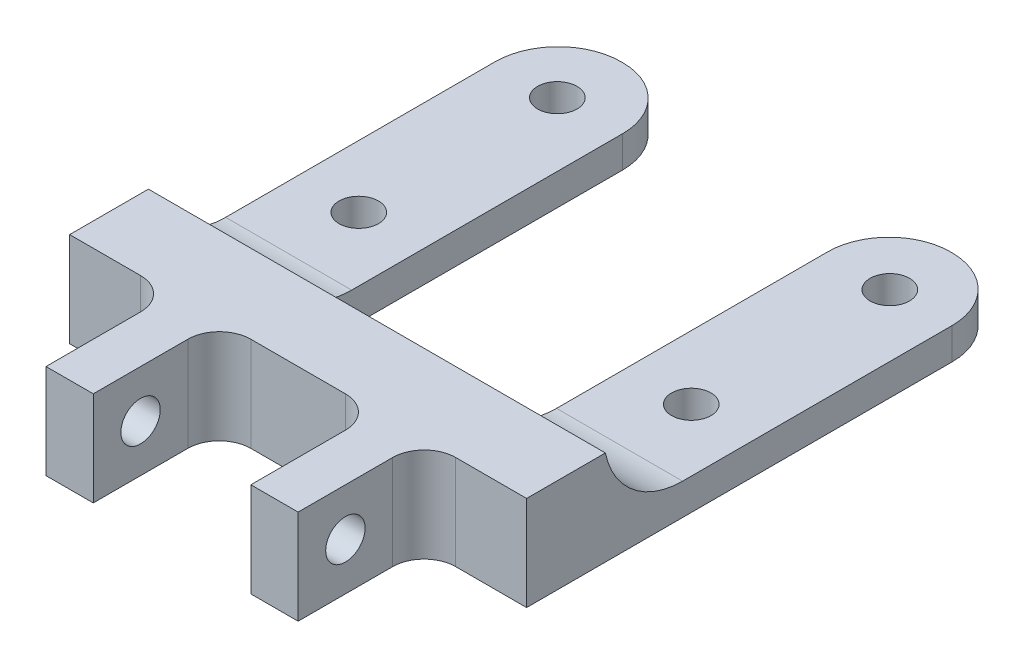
ISO-10303-21;
HEADER;
FILE_DESCRIPTION(('STEP AP214'),'2;1');
FILE_NAME('part.step','',(''),(''),'','','');
FILE_SCHEMA(('AUTOMOTIVE_DESIGN { 1 0 10303 214 1 1 1 1 }'));
ENDSEC;
DATA;
#1=APPLICATION_CONTEXT('core data for automotive mechanical design processes');
#2=APPLICATION_PROTOCOL_DEFINITION('international standard','automotive_design',2000,#1);
#3=PRODUCT_CONTEXT('',#1,'mechanical');
#4=PRODUCT('Part','Part','',(#3));
#5=PRODUCT_RELATED_PRODUCT_CATEGORY('part','',(#4));
#6=PRODUCT_DEFINITION_FORMATION('','',#4);
#7=PRODUCT_DEFINITION_CONTEXT('part definition',#1,'design');
#8=PRODUCT_DEFINITION('design','',#6,#7);
#9=PRODUCT_DEFINITION_SHAPE('','',#8);
#10=(LENGTH_UNIT() NAMED_UNIT(*) SI_UNIT(.MILLI.,.METRE.));
#11=(NAMED_UNIT(*) PLANE_ANGLE_UNIT() SI_UNIT($,.RADIAN.));
#12=(NAMED_UNIT(*) SI_UNIT($,.STERADIAN.) SOLID_ANGLE_UNIT());
#13=UNCERTAINTY_MEASURE_WITH_UNIT(LENGTH_MEASURE(1.E-05),#10,'distance_accuracy_value','');
#14=(GEOMETRIC_REPRESENTATION_CONTEXT(3) GLOBAL_UNCERTAINTY_ASSIGNED_CONTEXT((#13)) GLOBAL_UNIT_ASSIGNED_CONTEXT((#10,
#11,#12)) REPRESENTATION_CONTEXT('',''));
#15=CARTESIAN_POINT('',(0.,0.,0.));
#16=DIRECTION('',(0.,0.,1.));
#17=DIRECTION('',(1.,0.,0.));
#18=AXIS2_PLACEMENT_3D('',#15,#16,#17);
#19=CARTESIAN_POINT('',(0.,0.,5.));
#20=DIRECTION('',(0.,0.,1.));
#21=DIRECTION('',(1.,0.,0.));
#22=AXIS2_PLACEMENT_3D('',#19,#20,#21);
#23=PLANE('',#22);
#24=DIRECTION('',(1.,0.,0.));
#25=VECTOR('',#24,1.);
#26=CARTESIAN_POINT('',(0.,0.,5.));
#27=LINE('',#26,#25);
#28=CARTESIAN_POINT('',(11.5,0.,5.));
#29=VERTEX_POINT('',#28);
#30=CARTESIAN_POINT('',(17.5,0.,5.));
#31=VERTEX_POINT('',#30);
#32=EDGE_CURVE('E282',#29,#31,#27,.T.);
#33=ORIENTED_EDGE('',*,*,#32,.T.);
#34=DIRECTION('',(0.,-1.,0.));
#35=VECTOR('',#34,1.);
#36=CARTESIAN_POINT('',(17.5,0.,5.));
#37=LINE('',#36,#35);
#38=CARTESIAN_POINT('',(17.5,6.,5.));
#39=VERTEX_POINT('',#38);
#40=EDGE_CURVE('E410',#31,#39,#37,.F.);
#41=ORIENTED_EDGE('',*,*,#40,.T.);
#42=DIRECTION('',(1.,0.,0.));
#43=VECTOR('',#42,1.);
#44=CARTESIAN_POINT('',(0.,6.,5.));
#45=LINE('',#44,#43);
#46=CARTESIAN_POINT('',(11.5,6.,5.));
#47=VERTEX_POINT('',#46);
#48=EDGE_CURVE('E273',#47,#39,#45,.T.);
#49=ORIENTED_EDGE('',*,*,#48,.F.);
#50=DIRECTION('',(0.,1.,0.));
#51=VECTOR('',#50,1.);
#52=CARTESIAN_POINT('',(11.5,0.,5.));
#53=LINE('',#52,#51);
#54=EDGE_CURVE('E408',#47,#29,#53,.F.);
#55=ORIENTED_EDGE('',*,*,#54,.T.);
#56=EDGE_LOOP('',(#33,#41,#49,#55));
#57=FACE_BOUND('',#56,.T.);
#58=ADVANCED_FACE('F35',(#57),#23,.T.);
#59=CARTESIAN_POINT('',(24.5,6.,5.));
#60=VERTEX_POINT('',#59);
#61=CARTESIAN_POINT('',(29.,6.,5.));
#62=VERTEX_POINT('',#61);
#63=EDGE_CURVE('E269',#60,#62,#45,.T.);
#64=ORIENTED_EDGE('',*,*,#63,.F.);
#65=DIRECTION('',(0.,1.,0.));
#66=VECTOR('',#65,1.);
#67=CARTESIAN_POINT('',(24.5,0.,5.));
#68=LINE('',#67,#66);
#69=CARTESIAN_POINT('',(24.5,0.,5.));
#70=VERTEX_POINT('',#69);
#71=EDGE_CURVE('E415',#60,#70,#68,.F.);
#72=ORIENTED_EDGE('',*,*,#71,.T.);
#73=CARTESIAN_POINT('',(29.,0.,5.));
#74=VERTEX_POINT('',#73);
#75=EDGE_CURVE('E278',#70,#74,#27,.T.);
#76=ORIENTED_EDGE('',*,*,#75,.T.);
#77=DIRECTION('',(0.,1.,0.));
#78=VECTOR('',#77,1.);
#79=CARTESIAN_POINT('',(29.,0.,5.));
#80=LINE('',#79,#78);
#81=EDGE_CURVE('E283',#74,#62,#80,.T.);
#82=ORIENTED_EDGE('',*,*,#81,.T.);
#83=EDGE_LOOP('',(#64,#72,#76,#82));
#84=FACE_BOUND('',#83,.T.);
#85=ADVANCED_FACE('F463',(#84),#23,.T.);
#86=CARTESIAN_POINT('',(0.,2.,0.));
#87=DIRECTION('',(0.,1.,0.));
#88=DIRECTION('',(0.,0.,1.));
#89=AXIS2_PLACEMENT_3D('',#86,#87,#88);
#90=PLANE('',#89);
#91=CARTESIAN_POINT('',(3.95,2.,-22.));
#92=DIRECTION('',(0.,1.,0.));
#93=DIRECTION('',(0.,0.,1.));
#94=AXIS2_PLACEMENT_3D('',#91,#92,#93);
#95=CIRCLE('',#94,1.25);
#96=CARTESIAN_POINT('',(3.95,2.,-20.75));
#97=VERTEX_POINT('',#96);
#98=EDGE_CURVE('E325',#97,#97,#95,.T.);
#99=ORIENTED_EDGE('',*,*,#98,.F.);
#100=EDGE_LOOP('',(#99));
#101=FACE_BOUND('',#100,.T.);
#102=CARTESIAN_POINT('',(3.95,2.,-9.4));
#103=DIRECTION('',(0.,1.,0.));
#104=DIRECTION('',(0.,0.,1.));
#105=AXIS2_PLACEMENT_3D('',#102,#103,#104);
#106=CIRCLE('',#105,1.25);
#107=CARTESIAN_POINT('',(3.95,2.,-8.15));
#108=VERTEX_POINT('',#107);
#109=EDGE_CURVE('E316',#108,#108,#106,.T.);
#110=ORIENTED_EDGE('',*,*,#109,.F.);
#111=EDGE_LOOP('',(#110));
#112=FACE_BOUND('',#111,.T.);
#113=DIRECTION('',(0.,0.,-1.));
#114=VECTOR('',#113,1.);
#115=CARTESIAN_POINT('',(0.,2.,0.));
#116=LINE('',#115,#114);
#117=CARTESIAN_POINT('',(0.,2.,-4.89897948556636));
#118=VERTEX_POINT('',#117);
#119=CARTESIAN_POINT('',(0.,2.,-22.));
#120=VERTEX_POINT('',#119);
#121=EDGE_CURVE('E298',#118,#120,#116,.T.);
#122=ORIENTED_EDGE('',*,*,#121,.F.);
#123=DIRECTION('',(-1.,0.,0.));
#124=VECTOR('',#123,1.);
#125=CARTESIAN_POINT('',(29.,2.,-4.89897948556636));
#126=LINE('',#125,#124);
#127=CARTESIAN_POINT('',(8.,2.,-4.89897948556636));
#128=VERTEX_POINT('',#127);
#129=EDGE_CURVE('E392',#118,#128,#126,.F.);
#130=ORIENTED_EDGE('',*,*,#129,.T.);
#131=DIRECTION('',(0.,0.,1.));
#132=VECTOR('',#131,1.);
#133=CARTESIAN_POINT('',(8.,2.,0.));
#134=LINE('',#133,#132);
#135=CARTESIAN_POINT('',(8.,2.,-22.1));
#136=VERTEX_POINT('',#135);
#137=EDGE_CURVE('E313',#136,#128,#134,.T.);
#138=ORIENTED_EDGE('',*,*,#137,.F.);
#139=CARTESIAN_POINT('',(4.1,2.,-22.1));
#140=DIRECTION('',(0.,1.,0.));
#141=DIRECTION('',(0.,0.,1.));
#142=AXIS2_PLACEMENT_3D('',#139,#140,#141);
#143=CIRCLE('',#142,3.9);
#144=CARTESIAN_POINT('',(4.09999999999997,2.,-26.));
#145=VERTEX_POINT('',#144);
#146=EDGE_CURVE('E288',#145,#136,#143,.F.);
#147=ORIENTED_EDGE('',*,*,#146,.F.);
#148=DIRECTION('',(1.,0.,0.));
#149=VECTOR('',#148,1.);
#150=CARTESIAN_POINT('',(0.,2.,-26.));
#151=LINE('',#150,#149);
#152=CARTESIAN_POINT('',(4.00000000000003,2.,-26.));
#153=VERTEX_POINT('',#152);
#154=EDGE_CURVE('E291',#153,#145,#151,.T.);
#155=ORIENTED_EDGE('',*,*,#154,.F.);
#156=CARTESIAN_POINT('',(4.,2.,-22.));
#157=DIRECTION('',(0.,1.,0.));
#158=DIRECTION('',(0.,0.,1.));
#159=AXIS2_PLACEMENT_3D('',#156,#157,#158);
#160=CIRCLE('',#159,4.);
#161=EDGE_CURVE('E295',#120,#153,#160,.F.);
#162=ORIENTED_EDGE('',*,*,#161,.F.);
#163=EDGE_LOOP('',(#122,#130,#138,#147,#155,#162));
#164=FACE_BOUND('',#163,.T.);
#165=ADVANCED_FACE('F509',(#101,#112,#164),#90,.T.);
#166=CARTESIAN_POINT('',(4.1,2.,-22.1));
#167=DIRECTION('',(0.,-1.,0.));
#168=DIRECTION('',(0.,0.,-1.));
#169=AXIS2_PLACEMENT_3D('',#166,#167,#168);
#170=CYLINDRICAL_SURFACE('',#169,3.9);
#171=CARTESIAN_POINT('',(4.1,0.,-22.1));
#172=DIRECTION('',(0.,1.,0.));
#173=DIRECTION('',(0.,0.,1.));
#174=AXIS2_PLACEMENT_3D('',#171,#172,#173);
#175=CIRCLE('',#174,3.9);
#176=CARTESIAN_POINT('',(4.09999999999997,0.,-26.));
#177=VERTEX_POINT('',#176);
#178=CARTESIAN_POINT('',(8.,0.,-22.1));
#179=VERTEX_POINT('',#178);
#180=EDGE_CURVE('E286',#177,#179,#175,.F.);
#181=ORIENTED_EDGE('',*,*,#180,.F.);
#182=DIRECTION('',(0.,-1.,0.));
#183=VECTOR('',#182,1.);
#184=CARTESIAN_POINT('',(4.09999999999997,2.,-26.));
#185=LINE('',#184,#183);
#186=EDGE_CURVE('E388',#145,#177,#185,.T.);
#187=ORIENTED_EDGE('',*,*,#186,.F.);
#188=ORIENTED_EDGE('',*,*,#146,.T.);
#189=DIRECTION('',(0.,-1.,0.));
#190=VECTOR('',#189,1.);
#191=CARTESIAN_POINT('',(8.,2.,-22.1));
#192=LINE('',#191,#190);
#193=EDGE_CURVE('E328',#136,#179,#192,.T.);
#194=ORIENTED_EDGE('',*,*,#193,.T.);
#195=EDGE_LOOP('',(#181,#187,#188,#194));
#196=FACE_BOUND('',#195,.T.);
#197=ADVANCED_FACE('F575',(#196),#170,.T.);
#198=CARTESIAN_POINT('',(0.,2.,-26.));
#199=DIRECTION('',(0.,0.,-1.));
#200=DIRECTION('',(-1.,0.,0.));
#201=AXIS2_PLACEMENT_3D('',#198,#199,#200);
#202=PLANE('',#201);
#203=DIRECTION('',(1.,0.,0.));
#204=VECTOR('',#203,1.);
#205=CARTESIAN_POINT('',(0.,0.,-26.));
#206=LINE('',#205,#204);
#207=CARTESIAN_POINT('',(4.00000000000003,0.,-26.));
#208=VERTEX_POINT('',#207);
#209=EDGE_CURVE('E330',#208,#177,#206,.T.);
#210=ORIENTED_EDGE('',*,*,#209,.F.);
#211=DIRECTION('',(0.,-1.,0.));
#212=VECTOR('',#211,1.);
#213=CARTESIAN_POINT('',(4.00000000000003,2.,-26.));
#214=LINE('',#213,#212);
#215=EDGE_CURVE('E386',#153,#208,#214,.T.);
#216=ORIENTED_EDGE('',*,*,#215,.F.);
#217=ORIENTED_EDGE('',*,*,#154,.T.);
#218=ORIENTED_EDGE('',*,*,#186,.T.);
#219=EDGE_LOOP('',(#210,#216,#217,#218));
#220=FACE_BOUND('',#219,.T.);
#221=ADVANCED_FACE('F571',(#220),#202,.T.);
#222=CARTESIAN_POINT('',(4.,2.,-22.));
#223=DIRECTION('',(0.,-1.,0.));
#224=DIRECTION('',(0.,0.,-1.));
#225=AXIS2_PLACEMENT_3D('',#222,#223,#224);
#226=CYLINDRICAL_SURFACE('',#225,4.);
#227=CARTESIAN_POINT('',(4.,0.,-22.));
#228=DIRECTION('',(0.,1.,0.));
#229=DIRECTION('',(0.,0.,1.));
#230=AXIS2_PLACEMENT_3D('',#227,#228,#229);
#231=CIRCLE('',#230,4.);
#232=CARTESIAN_POINT('',(0.,0.,-22.));
#233=VERTEX_POINT('',#232);
#234=EDGE_CURVE('E333',#233,#208,#231,.F.);
#235=ORIENTED_EDGE('',*,*,#234,.F.);
#236=DIRECTION('',(0.,-1.,0.));
#237=VECTOR('',#236,1.);
#238=CARTESIAN_POINT('',(0.,2.,-22.));
#239=LINE('',#238,#237);
#240=EDGE_CURVE('E384',#120,#233,#239,.T.);
#241=ORIENTED_EDGE('',*,*,#240,.F.);
#242=ORIENTED_EDGE('',*,*,#161,.T.);
#243=ORIENTED_EDGE('',*,*,#215,.T.);
#244=EDGE_LOOP('',(#235,#241,#242,#243));
#245=FACE_BOUND('',#244,.T.);
#246=ADVANCED_FACE('F568',(#245),#226,.T.);
#247=CARTESIAN_POINT('',(0.,2.,0.));
#248=DIRECTION('',(-1.,0.,0.));
#249=DIRECTION('',(0.,0.,1.));
#250=AXIS2_PLACEMENT_3D('',#247,#248,#249);
#251=PLANE('',#250);
#252=DIRECTION('',(0.,0.,-1.));
#253=VECTOR('',#252,1.);
#254=CARTESIAN_POINT('',(0.,0.,0.));
#255=LINE('',#254,#253);
#256=CARTESIAN_POINT('',(0.,0.,5.));
#257=VERTEX_POINT('',#256);
#258=EDGE_CURVE('E336',#257,#233,#255,.T.);
#259=ORIENTED_EDGE('',*,*,#258,.F.);
#260=DIRECTION('',(0.,1.,0.));
#261=VECTOR('',#260,1.);
#262=CARTESIAN_POINT('',(0.,0.,5.));
#263=LINE('',#262,#261);
#264=CARTESIAN_POINT('',(0.,6.,5.));
#265=VERTEX_POINT('',#264);
#266=EDGE_CURVE('E281',#257,#265,#263,.T.);
#267=ORIENTED_EDGE('',*,*,#266,.T.);
#268=DIRECTION('',(0.,0.,1.));
#269=VECTOR('',#268,1.);
#270=CARTESIAN_POINT('',(0.,6.,0.));
#271=LINE('',#270,#269);
#272=CARTESIAN_POINT('',(0.,6.,0.));
#273=VERTEX_POINT('',#272);
#274=EDGE_CURVE('E266',#273,#265,#271,.T.);
#275=ORIENTED_EDGE('',*,*,#274,.F.);
#276=CARTESIAN_POINT('',(0.,7.,-4.89897948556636));
#277=DIRECTION('',(-1.,0.,0.));
#278=DIRECTION('',(0.,0.,1.));
#279=AXIS2_PLACEMENT_3D('',#276,#277,#278);
#280=CIRCLE('',#279,5.);
#281=EDGE_CURVE('E405',#273,#118,#280,.F.);
#282=ORIENTED_EDGE('',*,*,#281,.T.);
#283=ORIENTED_EDGE('',*,*,#121,.T.);
#284=ORIENTED_EDGE('',*,*,#240,.T.);
#285=EDGE_LOOP('',(#259,#267,#275,#282,#283,#284));
#286=FACE_BOUND('',#285,.T.);
#287=ADVANCED_FACE('F479',(#286),#251,.T.);
#288=CARTESIAN_POINT('',(29.,2.,0.));
#289=DIRECTION('',(-1.,0.,0.));
#290=DIRECTION('',(0.,0.,1.));
#291=AXIS2_PLACEMENT_3D('',#288,#289,#290);
#292=PLANE('',#291);
#293=DIRECTION('',(0.,0.,-1.));
#294=VECTOR('',#293,1.);
#295=CARTESIAN_POINT('',(29.,0.,0.));
#296=LINE('',#295,#294);
#297=CARTESIAN_POINT('',(29.,0.,-22.));
#298=VERTEX_POINT('',#297);
#299=EDGE_CURVE('E339',#74,#298,#296,.T.);
#300=ORIENTED_EDGE('',*,*,#299,.T.);
#301=DIRECTION('',(0.,-1.,0.));
#302=VECTOR('',#301,1.);
#303=CARTESIAN_POINT('',(29.,2.,-22.));
#304=LINE('',#303,#302);
#305=CARTESIAN_POINT('',(29.,2.,-22.));
#306=VERTEX_POINT('',#305);
#307=EDGE_CURVE('E382',#306,#298,#304,.T.);
#308=ORIENTED_EDGE('',*,*,#307,.F.);
#309=DIRECTION('',(0.,0.,-1.));
#310=VECTOR('',#309,1.);
#311=CARTESIAN_POINT('',(29.,2.,0.));
#312=LINE('',#311,#310);
#313=CARTESIAN_POINT('',(29.,2.,-4.89897948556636));
#314=VERTEX_POINT('',#313);
#315=EDGE_CURVE('E300',#314,#306,#312,.T.);
#316=ORIENTED_EDGE('',*,*,#315,.F.);
#317=CARTESIAN_POINT('',(29.,7.,-4.89897948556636));
#318=DIRECTION('',(-1.,0.,0.));
#319=DIRECTION('',(0.,0.,1.));
#320=AXIS2_PLACEMENT_3D('',#317,#318,#319);
#321=CIRCLE('',#320,5.);
#322=CARTESIAN_POINT('',(29.,6.,0.));
#323=VERTEX_POINT('',#322);
#324=EDGE_CURVE('E403',#314,#323,#321,.T.);
#325=ORIENTED_EDGE('',*,*,#324,.T.);
#326=DIRECTION('',(0.,0.,-1.));
#327=VECTOR('',#326,1.);
#328=CARTESIAN_POINT('',(29.,6.,0.));
#329=LINE('',#328,#327);
#330=EDGE_CURVE('E272',#62,#323,#329,.T.);
#331=ORIENTED_EDGE('',*,*,#330,.F.);
#332=ORIENTED_EDGE('',*,*,#81,.F.);
#333=EDGE_LOOP('',(#300,#308,#316,#325,#331,#332));
#334=FACE_BOUND('',#333,.T.);
#335=ADVANCED_FACE('F467',(#334),#292,.F.);
#336=CARTESIAN_POINT('',(25.,2.,-22.));
#337=DIRECTION('',(0.,-1.,0.));
#338=DIRECTION('',(0.,0.,-1.));
#339=AXIS2_PLACEMENT_3D('',#336,#337,#338);
#340=CYLINDRICAL_SURFACE('',#339,4.);
#341=CARTESIAN_POINT('',(25.,0.,-22.));
#342=DIRECTION('',(0.,1.,0.));
#343=DIRECTION('',(0.,0.,1.));
#344=AXIS2_PLACEMENT_3D('',#341,#342,#343);
#345=CIRCLE('',#344,4.);
#346=CARTESIAN_POINT('',(25.,0.,-26.));
#347=VERTEX_POINT('',#346);
#348=EDGE_CURVE('E342',#347,#298,#345,.F.);
#349=ORIENTED_EDGE('',*,*,#348,.F.);
#350=DIRECTION('',(0.,-1.,0.));
#351=VECTOR('',#350,1.);
#352=CARTESIAN_POINT('',(25.,2.,-26.));
#353=LINE('',#352,#351);
#354=CARTESIAN_POINT('',(25.,2.,-26.));
#355=VERTEX_POINT('',#354);
#356=EDGE_CURVE('E380',#355,#347,#353,.T.);
#357=ORIENTED_EDGE('',*,*,#356,.F.);
#358=CARTESIAN_POINT('',(25.,2.,-22.));
#359=DIRECTION('',(0.,1.,0.));
#360=DIRECTION('',(0.,0.,1.));
#361=AXIS2_PLACEMENT_3D('',#358,#359,#360);
#362=CIRCLE('',#361,4.);
#363=EDGE_CURVE('E302',#355,#306,#362,.F.);
#364=ORIENTED_EDGE('',*,*,#363,.T.);
#365=ORIENTED_EDGE('',*,*,#307,.T.);
#366=EDGE_LOOP('',(#349,#357,#364,#365));
#367=FACE_BOUND('',#366,.T.);
#368=ADVANCED_FACE('F559',(#367),#340,.T.);
#369=CARTESIAN_POINT('',(0.,2.,-26.));
#370=DIRECTION('',(0.,0.,-1.));
#371=DIRECTION('',(-1.,0.,0.));
#372=AXIS2_PLACEMENT_3D('',#369,#370,#371);
#373=PLANE('',#372);
#374=DIRECTION('',(1.,0.,0.));
#375=VECTOR('',#374,1.);
#376=CARTESIAN_POINT('',(0.,0.,-26.));
#377=LINE('',#376,#375);
#378=CARTESIAN_POINT('',(24.9,0.,-26.));
#379=VERTEX_POINT('',#378);
#380=EDGE_CURVE('E345',#379,#347,#377,.T.);
#381=ORIENTED_EDGE('',*,*,#380,.F.);
#382=DIRECTION('',(0.,-1.,0.));
#383=VECTOR('',#382,1.);
#384=CARTESIAN_POINT('',(24.9,2.,-26.));
#385=LINE('',#384,#383);
#386=CARTESIAN_POINT('',(24.9,2.,-26.));
#387=VERTEX_POINT('',#386);
#388=EDGE_CURVE('E378',#387,#379,#385,.T.);
#389=ORIENTED_EDGE('',*,*,#388,.F.);
#390=DIRECTION('',(1.,0.,0.));
#391=VECTOR('',#390,1.);
#392=CARTESIAN_POINT('',(0.,2.,-26.));
#393=LINE('',#392,#391);
#394=EDGE_CURVE('E305',#387,#355,#393,.T.);
#395=ORIENTED_EDGE('',*,*,#394,.T.);
#396=ORIENTED_EDGE('',*,*,#356,.T.);
#397=EDGE_LOOP('',(#381,#389,#395,#396));
#398=FACE_BOUND('',#397,.T.);
#399=ADVANCED_FACE('F555',(#398),#373,.T.);
#400=CARTESIAN_POINT('',(24.9,2.,-22.1));
#401=DIRECTION('',(0.,-1.,0.));
#402=DIRECTION('',(0.,0.,-1.));
#403=AXIS2_PLACEMENT_3D('',#400,#401,#402);
#404=CYLINDRICAL_SURFACE('',#403,3.9);
#405=CARTESIAN_POINT('',(24.9,0.,-22.1));
#406=DIRECTION('',(0.,1.,0.));
#407=DIRECTION('',(0.,0.,1.));
#408=AXIS2_PLACEMENT_3D('',#405,#406,#407);
#409=CIRCLE('',#408,3.9);
#410=CARTESIAN_POINT('',(21.,0.,-22.1));
#411=VERTEX_POINT('',#410);
#412=EDGE_CURVE('E348',#379,#411,#409,.T.);
#413=ORIENTED_EDGE('',*,*,#412,.T.);
#414=DIRECTION('',(0.,-1.,0.));
#415=VECTOR('',#414,1.);
#416=CARTESIAN_POINT('',(21.,2.,-22.1));
#417=LINE('',#416,#415);
#418=CARTESIAN_POINT('',(21.,2.,-22.1));
#419=VERTEX_POINT('',#418);
#420=EDGE_CURVE('E375',#419,#411,#417,.T.);
#421=ORIENTED_EDGE('',*,*,#420,.F.);
#422=CARTESIAN_POINT('',(24.9,2.,-22.1));
#423=DIRECTION('',(0.,1.,0.));
#424=DIRECTION('',(0.,0.,1.));
#425=AXIS2_PLACEMENT_3D('',#422,#423,#424);
#426=CIRCLE('',#425,3.9);
#427=EDGE_CURVE('E308',#387,#419,#426,.T.);
#428=ORIENTED_EDGE('',*,*,#427,.F.);
#429=ORIENTED_EDGE('',*,*,#388,.T.);
#430=EDGE_LOOP('',(#413,#421,#428,#429));
#431=FACE_BOUND('',#430,.T.);
#432=ADVANCED_FACE('F551',(#431),#404,.T.);
#433=CARTESIAN_POINT('',(21.,2.,0.));
#434=DIRECTION('',(1.,0.,0.));
#435=DIRECTION('',(0.,0.,-1.));
#436=AXIS2_PLACEMENT_3D('',#433,#434,#435);
#437=PLANE('',#436);
#438=DIRECTION('',(0.,0.,1.));
#439=VECTOR('',#438,1.);
#440=CARTESIAN_POINT('',(21.,0.,0.));
#441=LINE('',#440,#439);
#442=CARTESIAN_POINT('',(21.,0.,-3.5));
#443=VERTEX_POINT('',#442);
#444=EDGE_CURVE('E350',#411,#443,#441,.T.);
#445=ORIENTED_EDGE('',*,*,#444,.T.);
#446=DIRECTION('',(0.,-1.,0.));
#447=VECTOR('',#446,1.);
#448=CARTESIAN_POINT('',(21.,2.,-3.5));
#449=LINE('',#448,#447);
#450=CARTESIAN_POINT('',(21.,2.1997024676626,-3.5));
#451=VERTEX_POINT('',#450);
#452=EDGE_CURVE('E373',#451,#443,#449,.T.);
#453=ORIENTED_EDGE('',*,*,#452,.F.);
#454=CARTESIAN_POINT('',(21.,7.,-4.89897948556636));
#455=DIRECTION('',(1.,0.,0.));
#456=DIRECTION('',(0.,0.,-1.));
#457=AXIS2_PLACEMENT_3D('',#454,#455,#456);
#458=CIRCLE('',#457,5.);
#459=CARTESIAN_POINT('',(21.,2.,-4.89897948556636));
#460=VERTEX_POINT('',#459);
#461=EDGE_CURVE('E401',#451,#460,#458,.T.);
#462=ORIENTED_EDGE('',*,*,#461,.T.);
#463=DIRECTION('',(0.,0.,1.));
#464=VECTOR('',#463,1.);
#465=CARTESIAN_POINT('',(21.,2.,0.));
#466=LINE('',#465,#464);
#467=EDGE_CURVE('E310',#419,#460,#466,.T.);
#468=ORIENTED_EDGE('',*,*,#467,.F.);
#469=ORIENTED_EDGE('',*,*,#420,.T.);
#470=EDGE_LOOP('',(#445,#453,#462,#468,#469));
#471=FACE_BOUND('',#470,.T.);
#472=ADVANCED_FACE('F547',(#471),#437,.F.);
#473=CARTESIAN_POINT('',(0.,2.,-3.5));
#474=DIRECTION('',(0.,0.,-1.));
#475=DIRECTION('',(-1.,0.,0.));
#476=AXIS2_PLACEMENT_3D('',#473,#474,#475);
#477=PLANE('',#476);
#478=DIRECTION('',(1.,0.,0.));
#479=VECTOR('',#478,1.);
#480=CARTESIAN_POINT('',(0.,0.,-3.5));
#481=LINE('',#480,#479);
#482=CARTESIAN_POINT('',(8.,0.,-3.5));
#483=VERTEX_POINT('',#482);
#484=EDGE_CURVE('E353',#483,#443,#481,.T.);
#485=ORIENTED_EDGE('',*,*,#484,.F.);
#486=DIRECTION('',(0.,-1.,0.));
#487=VECTOR('',#486,1.);
#488=CARTESIAN_POINT('',(8.,2.,-3.5));
#489=LINE('',#488,#487);
#490=CARTESIAN_POINT('',(8.,2.1997024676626,-3.5));
#491=VERTEX_POINT('',#490);
#492=EDGE_CURVE('E371',#491,#483,#489,.T.);
#493=ORIENTED_EDGE('',*,*,#492,.F.);
#494=DIRECTION('',(1.,0.,0.));
#495=VECTOR('',#494,1.);
#496=CARTESIAN_POINT('',(8.,2.1997024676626,-3.5));
#497=LINE('',#496,#495);
#498=EDGE_CURVE('E398',#491,#451,#497,.T.);
#499=ORIENTED_EDGE('',*,*,#498,.T.);
#500=ORIENTED_EDGE('',*,*,#452,.T.);
#501=EDGE_LOOP('',(#485,#493,#499,#500));
#502=FACE_BOUND('',#501,.T.);
#503=ADVANCED_FACE('F533',(#502),#477,.T.);
#504=CARTESIAN_POINT('',(25.05,2.,-22.));
#505=DIRECTION('',(0.,-1.,0.));
#506=DIRECTION('',(0.,0.,-1.));
#507=AXIS2_PLACEMENT_3D('',#504,#505,#506);
#508=CYLINDRICAL_SURFACE('',#507,1.25);
#509=CARTESIAN_POINT('',(25.05,2.,-22.));
#510=DIRECTION('',(0.,1.,0.));
#511=DIRECTION('',(0.,0.,1.));
#512=AXIS2_PLACEMENT_3D('',#509,#510,#511);
#513=CIRCLE('',#512,1.25);
#514=CARTESIAN_POINT('',(25.05,2.,-20.75));
#515=VERTEX_POINT('',#514);
#516=EDGE_CURVE('E322',#515,#515,#513,.T.);
#517=ORIENTED_EDGE('',*,*,#516,.T.);
#518=EDGE_LOOP('',(#517));
#519=FACE_BOUND('',#518,.T.);
#520=CARTESIAN_POINT('',(25.05,0.,-22.));
#521=DIRECTION('',(0.,1.,0.));
#522=DIRECTION('',(0.,0.,1.));
#523=AXIS2_PLACEMENT_3D('',#520,#521,#522);
#524=CIRCLE('',#523,1.25);
#525=CARTESIAN_POINT('',(25.05,0.,-20.75));
#526=VERTEX_POINT('',#525);
#527=EDGE_CURVE('E365',#526,#526,#524,.T.);
#528=ORIENTED_EDGE('',*,*,#527,.F.);
#529=EDGE_LOOP('',(#528));
#530=FACE_BOUND('',#529,.T.);
#531=ADVANCED_FACE('F529',(#519,#530),#508,.F.);
#532=CARTESIAN_POINT('',(25.05,2.,-9.4));
#533=DIRECTION('',(0.,-1.,0.));
#534=DIRECTION('',(0.,0.,-1.));
#535=AXIS2_PLACEMENT_3D('',#532,#533,#534);
#536=CYLINDRICAL_SURFACE('',#535,1.25);
#537=CARTESIAN_POINT('',(25.05,2.,-9.4));
#538=DIRECTION('',(0.,1.,0.));
#539=DIRECTION('',(0.,0.,1.));
#540=AXIS2_PLACEMENT_3D('',#537,#538,#539);
#541=CIRCLE('',#540,1.25);
#542=CARTESIAN_POINT('',(25.05,2.,-8.15));
#543=VERTEX_POINT('',#542);
#544=EDGE_CURVE('E319',#543,#543,#541,.T.);
#545=ORIENTED_EDGE('',*,*,#544,.T.);
#546=EDGE_LOOP('',(#545));
#547=FACE_BOUND('',#546,.T.);
#548=CARTESIAN_POINT('',(25.05,0.,-9.4));
#549=DIRECTION('',(0.,1.,0.));
#550=DIRECTION('',(0.,0.,1.));
#551=AXIS2_PLACEMENT_3D('',#548,#549,#550);
#552=CIRCLE('',#551,1.25);
#553=CARTESIAN_POINT('',(25.05,0.,-8.15));
#554=VERTEX_POINT('',#553);
#555=EDGE_CURVE('E362',#554,#554,#552,.T.);
#556=ORIENTED_EDGE('',*,*,#555,.F.);
#557=EDGE_LOOP('',(#556));
#558=FACE_BOUND('',#557,.T.);
#559=ADVANCED_FACE('F532',(#547,#558),#536,.F.);
#560=CARTESIAN_POINT('',(3.95,2.,-9.4));
#561=DIRECTION('',(0.,-1.,0.));
#562=DIRECTION('',(0.,0.,-1.));
#563=AXIS2_PLACEMENT_3D('',#560,#561,#562);
#564=CYLINDRICAL_SURFACE('',#563,1.25);
#565=ORIENTED_EDGE('',*,*,#109,.T.);
#566=EDGE_LOOP('',(#565));
#567=FACE_BOUND('',#566,.T.);
#568=CARTESIAN_POINT('',(3.95,0.,-9.4));
#569=DIRECTION('',(0.,1.,0.));
#570=DIRECTION('',(0.,0.,1.));
#571=AXIS2_PLACEMENT_3D('',#568,#569,#570);
#572=CIRCLE('',#571,1.25);
#573=CARTESIAN_POINT('',(3.95,0.,-8.15));
#574=VERTEX_POINT('',#573);
#575=EDGE_CURVE('E359',#574,#574,#572,.T.);
#576=ORIENTED_EDGE('',*,*,#575,.F.);
#577=EDGE_LOOP('',(#576));
#578=FACE_BOUND('',#577,.T.);
#579=ADVANCED_FACE('F537',(#567,#578),#564,.F.);
#580=CARTESIAN_POINT('',(8.,2.,0.));
#581=DIRECTION('',(1.,0.,0.));
#582=DIRECTION('',(0.,0.,-1.));
#583=AXIS2_PLACEMENT_3D('',#580,#581,#582);
#584=PLANE('',#583);
#585=DIRECTION('',(0.,0.,1.));
#586=VECTOR('',#585,1.);
#587=CARTESIAN_POINT('',(8.,0.,0.));
#588=LINE('',#587,#586);
#589=EDGE_CURVE('E356',#179,#483,#588,.T.);
#590=ORIENTED_EDGE('',*,*,#589,.F.);
#591=ORIENTED_EDGE('',*,*,#193,.F.);
#592=ORIENTED_EDGE('',*,*,#137,.T.);
#593=CARTESIAN_POINT('',(8.,7.,-4.89897948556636));
#594=DIRECTION('',(1.,0.,0.));
#595=DIRECTION('',(0.,0.,-1.));
#596=AXIS2_PLACEMENT_3D('',#593,#594,#595);
#597=CIRCLE('',#596,5.);
#598=EDGE_CURVE('E395',#128,#491,#597,.F.);
#599=ORIENTED_EDGE('',*,*,#598,.T.);
#600=ORIENTED_EDGE('',*,*,#492,.T.);
#601=EDGE_LOOP('',(#590,#591,#592,#599,#600));
#602=FACE_BOUND('',#601,.T.);
#603=ADVANCED_FACE('F527',(#602),#584,.T.);
#604=CARTESIAN_POINT('',(3.95,2.,-22.));
#605=DIRECTION('',(0.,-1.,0.));
#606=DIRECTION('',(0.,0.,-1.));
#607=AXIS2_PLACEMENT_3D('',#604,#605,#606);
#608=CYLINDRICAL_SURFACE('',#607,1.25);
#609=ORIENTED_EDGE('',*,*,#98,.T.);
#610=EDGE_LOOP('',(#609));
#611=FACE_BOUND('',#610,.T.);
#612=CARTESIAN_POINT('',(3.95,0.,-22.));
#613=DIRECTION('',(0.,1.,0.));
#614=DIRECTION('',(0.,0.,1.));
#615=AXIS2_PLACEMENT_3D('',#612,#613,#614);
#616=CIRCLE('',#615,1.25);
#617=CARTESIAN_POINT('',(3.95,0.,-20.75));
#618=VERTEX_POINT('',#617);
#619=EDGE_CURVE('E292',#618,#618,#616,.T.);
#620=ORIENTED_EDGE('',*,*,#619,.F.);
#621=EDGE_LOOP('',(#620));
#622=FACE_BOUND('',#621,.T.);
#623=ADVANCED_FACE('F522',(#611,#622),#608,.F.);
#624=ORIENTED_EDGE('',*,*,#467,.T.);
#625=DIRECTION('',(-1.,0.,0.));
#626=VECTOR('',#625,1.);
#627=CARTESIAN_POINT('',(29.,2.,-4.89897948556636));
#628=LINE('',#627,#626);
#629=EDGE_CURVE('E390',#460,#314,#628,.F.);
#630=ORIENTED_EDGE('',*,*,#629,.T.);
#631=ORIENTED_EDGE('',*,*,#315,.T.);
#632=ORIENTED_EDGE('',*,*,#363,.F.);
#633=ORIENTED_EDGE('',*,*,#394,.F.);
#634=ORIENTED_EDGE('',*,*,#427,.T.);
#635=EDGE_LOOP('',(#624,#630,#631,#632,#633,#634));
#636=FACE_BOUND('',#635,.T.);
#637=ORIENTED_EDGE('',*,*,#544,.F.);
#638=EDGE_LOOP('',(#637));
#639=FACE_BOUND('',#638,.T.);
#640=ORIENTED_EDGE('',*,*,#516,.F.);
#641=EDGE_LOOP('',(#640));
#642=FACE_BOUND('',#641,.T.);
#643=ADVANCED_FACE('F517',(#636,#639,#642),#90,.T.);
#644=CARTESIAN_POINT('',(0.,0.,0.));
#645=DIRECTION('',(0.,1.,0.));
#646=DIRECTION('',(0.,0.,1.));
#647=AXIS2_PLACEMENT_3D('',#644,#645,#646);
#648=PLANE('',#647);
#649=ORIENTED_EDGE('',*,*,#180,.T.);
#650=ORIENTED_EDGE('',*,*,#589,.T.);
#651=ORIENTED_EDGE('',*,*,#484,.T.);
#652=ORIENTED_EDGE('',*,*,#444,.F.);
#653=ORIENTED_EDGE('',*,*,#412,.F.);
#654=ORIENTED_EDGE('',*,*,#380,.T.);
#655=ORIENTED_EDGE('',*,*,#348,.T.);
#656=ORIENTED_EDGE('',*,*,#299,.F.);
#657=ORIENTED_EDGE('',*,*,#75,.F.);
#658=CARTESIAN_POINT('',(24.5,0.,7.));
#659=DIRECTION('',(0.,1.,0.));
#660=DIRECTION('',(0.,0.,1.));
#661=AXIS2_PLACEMENT_3D('',#658,#659,#660);
#662=CIRCLE('',#661,2.);
#663=CARTESIAN_POINT('',(22.5,0.,7.));
#664=VERTEX_POINT('',#663);
#665=EDGE_CURVE('E430',#70,#664,#662,.T.);
#666=ORIENTED_EDGE('',*,*,#665,.T.);
#667=DIRECTION('',(0.,0.,-1.));
#668=VECTOR('',#667,1.);
#669=CARTESIAN_POINT('',(22.5,0.,13.));
#670=LINE('',#669,#668);
#671=CARTESIAN_POINT('',(22.5,0.,13.));
#672=VERTEX_POINT('',#671);
#673=EDGE_CURVE('E222',#672,#664,#670,.T.);
#674=ORIENTED_EDGE('',*,*,#673,.F.);
#675=DIRECTION('',(1.,0.,0.));
#676=VECTOR('',#675,1.);
#677=CARTESIAN_POINT('',(19.5,0.,13.));
#678=LINE('',#677,#676);
#679=CARTESIAN_POINT('',(19.5,0.,13.));
#680=VERTEX_POINT('',#679);
#681=EDGE_CURVE('E214',#680,#672,#678,.T.);
#682=ORIENTED_EDGE('',*,*,#681,.F.);
#683=DIRECTION('',(0.,0.,-1.));
#684=VECTOR('',#683,1.);
#685=CARTESIAN_POINT('',(19.5,0.,13.));
#686=LINE('',#685,#684);
#687=CARTESIAN_POINT('',(19.5,0.,7.));
#688=VERTEX_POINT('',#687);
#689=EDGE_CURVE('E220',#680,#688,#686,.T.);
#690=ORIENTED_EDGE('',*,*,#689,.T.);
#691=CARTESIAN_POINT('',(17.5,0.,7.));
#692=DIRECTION('',(0.,1.,0.));
#693=DIRECTION('',(0.,0.,1.));
#694=AXIS2_PLACEMENT_3D('',#691,#692,#693);
#695=CIRCLE('',#694,2.);
#696=EDGE_CURVE('E424',#688,#31,#695,.T.);
#697=ORIENTED_EDGE('',*,*,#696,.T.);
#698=ORIENTED_EDGE('',*,*,#32,.F.);
#699=CARTESIAN_POINT('',(11.5,0.,7.));
#700=DIRECTION('',(0.,1.,0.));
#701=DIRECTION('',(0.,0.,1.));
#702=AXIS2_PLACEMENT_3D('',#699,#700,#701);
#703=CIRCLE('',#702,2.);
#704=CARTESIAN_POINT('',(9.5,0.,7.));
#705=VERTEX_POINT('',#704);
#706=EDGE_CURVE('E434',#29,#705,#703,.T.);
#707=ORIENTED_EDGE('',*,*,#706,.T.);
#708=DIRECTION('',(0.,0.,-1.));
#709=VECTOR('',#708,1.);
#710=CARTESIAN_POINT('',(9.5,0.,13.));
#711=LINE('',#710,#709);
#712=CARTESIAN_POINT('',(9.5,0.,13.));
#713=VERTEX_POINT('',#712);
#714=EDGE_CURVE('E255',#713,#705,#711,.T.);
#715=ORIENTED_EDGE('',*,*,#714,.F.);
#716=DIRECTION('',(1.,0.,0.));
#717=VECTOR('',#716,1.);
#718=CARTESIAN_POINT('',(9.5,0.,13.));
#719=LINE('',#718,#717);
#720=CARTESIAN_POINT('',(6.5,0.,13.));
#721=VERTEX_POINT('',#720);
#722=EDGE_CURVE('E253',#721,#713,#719,.T.);
#723=ORIENTED_EDGE('',*,*,#722,.F.);
#724=DIRECTION('',(0.,0.,-1.));
#725=VECTOR('',#724,1.);
#726=CARTESIAN_POINT('',(6.5,0.,13.));
#727=LINE('',#726,#725);
#728=CARTESIAN_POINT('',(6.5,0.,7.));
#729=VERTEX_POINT('',#728);
#730=EDGE_CURVE('E258',#721,#729,#727,.T.);
#731=ORIENTED_EDGE('',*,*,#730,.T.);
#732=CARTESIAN_POINT('',(4.5,0.,7.));
#733=DIRECTION('',(0.,1.,0.));
#734=DIRECTION('',(0.,0.,1.));
#735=AXIS2_PLACEMENT_3D('',#732,#733,#734);
#736=CIRCLE('',#735,2.);
#737=CARTESIAN_POINT('',(4.5,0.,5.));
#738=VERTEX_POINT('',#737);
#739=EDGE_CURVE('E44',#729,#738,#736,.T.);
#740=ORIENTED_EDGE('',*,*,#739,.T.);
#741=EDGE_CURVE('E279',#257,#738,#27,.T.);
#742=ORIENTED_EDGE('',*,*,#741,.F.);
#743=ORIENTED_EDGE('',*,*,#258,.T.);
#744=ORIENTED_EDGE('',*,*,#234,.T.);
#745=ORIENTED_EDGE('',*,*,#209,.T.);
#746=EDGE_LOOP('',(#649,#650,#651,#652,#653,#654,#655,#656,#657,#666,#674,#682,#690,#697,#698,
#707,#715,#723,#731,#740,#742,#743,#744,#745));
#747=FACE_BOUND('',#746,.T.);
#748=ORIENTED_EDGE('',*,*,#575,.T.);
#749=EDGE_LOOP('',(#748));
#750=FACE_BOUND('',#749,.T.);
#751=ORIENTED_EDGE('',*,*,#555,.T.);
#752=EDGE_LOOP('',(#751));
#753=FACE_BOUND('',#752,.T.);
#754=ORIENTED_EDGE('',*,*,#527,.T.);
#755=EDGE_LOOP('',(#754));
#756=FACE_BOUND('',#755,.T.);
#757=ORIENTED_EDGE('',*,*,#619,.T.);
#758=EDGE_LOOP('',(#757));
#759=FACE_BOUND('',#758,.T.);
#760=ADVANCED_FACE('F217',(#747,#750,#753,#756,#759),#648,.F.);
#761=ORIENTED_EDGE('',*,*,#741,.T.);
#762=DIRECTION('',(0.,-1.,0.));
#763=VECTOR('',#762,1.);
#764=CARTESIAN_POINT('',(4.5,0.,5.));
#765=LINE('',#764,#763);
#766=CARTESIAN_POINT('',(4.5,6.,5.));
#767=VERTEX_POINT('',#766);
#768=EDGE_CURVE('E57',#738,#767,#765,.F.);
#769=ORIENTED_EDGE('',*,*,#768,.T.);
#770=EDGE_CURVE('E270',#265,#767,#45,.T.);
#771=ORIENTED_EDGE('',*,*,#770,.F.);
#772=ORIENTED_EDGE('',*,*,#266,.F.);
#773=EDGE_LOOP('',(#761,#769,#771,#772));
#774=FACE_BOUND('',#773,.T.);
#775=ADVANCED_FACE('F482',(#774),#23,.T.);
#776=CARTESIAN_POINT('',(0.,6.,0.));
#777=DIRECTION('',(0.,1.,0.));
#778=DIRECTION('',(0.,0.,1.));
#779=AXIS2_PLACEMENT_3D('',#776,#777,#778);
#780=PLANE('',#779);
#781=ORIENTED_EDGE('',*,*,#274,.T.);
#782=ORIENTED_EDGE('',*,*,#770,.T.);
#783=CARTESIAN_POINT('',(4.5,6.,7.));
#784=DIRECTION('',(0.,1.,0.));
#785=DIRECTION('',(0.,0.,1.));
#786=AXIS2_PLACEMENT_3D('',#783,#784,#785);
#787=CIRCLE('',#786,2.);
#788=CARTESIAN_POINT('',(6.5,6.,7.));
#789=VERTEX_POINT('',#788);
#790=EDGE_CURVE('E11',#767,#789,#787,.F.);
#791=ORIENTED_EDGE('',*,*,#790,.T.);
#792=DIRECTION('',(0.,0.,-1.));
#793=VECTOR('',#792,1.);
#794=CARTESIAN_POINT('',(6.5,6.,13.));
#795=LINE('',#794,#793);
#796=CARTESIAN_POINT('',(6.5,6.,13.));
#797=VERTEX_POINT('',#796);
#798=EDGE_CURVE('E260',#797,#789,#795,.T.);
#799=ORIENTED_EDGE('',*,*,#798,.F.);
#800=DIRECTION('',(-1.,0.,0.));
#801=VECTOR('',#800,1.);
#802=CARTESIAN_POINT('',(9.5,6.,13.));
#803=LINE('',#802,#801);
#804=CARTESIAN_POINT('',(9.5,6.,13.));
#805=VERTEX_POINT('',#804);
#806=EDGE_CURVE('E244',#805,#797,#803,.T.);
#807=ORIENTED_EDGE('',*,*,#806,.F.);
#808=DIRECTION('',(0.,0.,-1.));
#809=VECTOR('',#808,1.);
#810=CARTESIAN_POINT('',(9.5,6.,13.));
#811=LINE('',#810,#809);
#812=CARTESIAN_POINT('',(9.5,6.,7.));
#813=VERTEX_POINT('',#812);
#814=EDGE_CURVE('E263',#805,#813,#811,.T.);
#815=ORIENTED_EDGE('',*,*,#814,.T.);
#816=CARTESIAN_POINT('',(11.5,6.,7.));
#817=DIRECTION('',(0.,1.,0.));
#818=DIRECTION('',(0.,0.,1.));
#819=AXIS2_PLACEMENT_3D('',#816,#817,#818);
#820=CIRCLE('',#819,2.);
#821=EDGE_CURVE('E432',#813,#47,#820,.F.);
#822=ORIENTED_EDGE('',*,*,#821,.T.);
#823=ORIENTED_EDGE('',*,*,#48,.T.);
#824=CARTESIAN_POINT('',(17.5,6.,7.));
#825=DIRECTION('',(0.,1.,0.));
#826=DIRECTION('',(0.,0.,1.));
#827=AXIS2_PLACEMENT_3D('',#824,#825,#826);
#828=CIRCLE('',#827,2.);
#829=CARTESIAN_POINT('',(19.5,6.,7.));
#830=VERTEX_POINT('',#829);
#831=EDGE_CURVE('E426',#39,#830,#828,.F.);
#832=ORIENTED_EDGE('',*,*,#831,.T.);
#833=DIRECTION('',(0.,0.,-1.));
#834=VECTOR('',#833,1.);
#835=CARTESIAN_POINT('',(19.5,6.,13.));
#836=LINE('',#835,#834);
#837=CARTESIAN_POINT('',(19.5,6.,13.));
#838=VERTEX_POINT('',#837);
#839=EDGE_CURVE('E618',#838,#830,#836,.T.);
#840=ORIENTED_EDGE('',*,*,#839,.F.);
#841=DIRECTION('',(-1.,0.,0.));
#842=VECTOR('',#841,1.);
#843=CARTESIAN_POINT('',(19.5,6.,13.));
#844=LINE('',#843,#842);
#845=CARTESIAN_POINT('',(22.5,6.,13.));
#846=VERTEX_POINT('',#845);
#847=EDGE_CURVE('E231',#846,#838,#844,.T.);
#848=ORIENTED_EDGE('',*,*,#847,.F.);
#849=DIRECTION('',(0.,0.,-1.));
#850=VECTOR('',#849,1.);
#851=CARTESIAN_POINT('',(22.5,6.,13.));
#852=LINE('',#851,#850);
#853=CARTESIAN_POINT('',(22.5,6.,7.));
#854=VERTEX_POINT('',#853);
#855=EDGE_CURVE('E246',#846,#854,#852,.T.);
#856=ORIENTED_EDGE('',*,*,#855,.T.);
#857=CARTESIAN_POINT('',(24.5,6.,7.));
#858=DIRECTION('',(0.,1.,0.));
#859=DIRECTION('',(0.,0.,1.));
#860=AXIS2_PLACEMENT_3D('',#857,#858,#859);
#861=CIRCLE('',#860,2.);
#862=EDGE_CURVE('E428',#854,#60,#861,.F.);
#863=ORIENTED_EDGE('',*,*,#862,.T.);
#864=ORIENTED_EDGE('',*,*,#63,.T.);
#865=ORIENTED_EDGE('',*,*,#330,.T.);
#866=DIRECTION('',(-1.,0.,0.));
#867=VECTOR('',#866,1.);
#868=CARTESIAN_POINT('',(0.,6.,0.));
#869=LINE('',#868,#867);
#870=EDGE_CURVE('E276',#323,#273,#869,.T.);
#871=ORIENTED_EDGE('',*,*,#870,.T.);
#872=EDGE_LOOP('',(#781,#782,#791,#799,#807,#815,#822,#823,#832,#840,#848,#856,#863,#864,#865,#871));
#873=FACE_BOUND('',#872,.T.);
#874=ADVANCED_FACE('F452',(#873),#780,.T.);
#875=CARTESIAN_POINT('',(0.,7.,-4.89897948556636));
#876=DIRECTION('',(1.,0.,0.));
#877=DIRECTION('',(0.,0.,-1.));
#878=AXIS2_PLACEMENT_3D('',#875,#876,#877);
#879=CYLINDRICAL_SURFACE('',#878,5.);
#880=ORIENTED_EDGE('',*,*,#281,.F.);
#881=ORIENTED_EDGE('',*,*,#870,.F.);
#882=ORIENTED_EDGE('',*,*,#324,.F.);
#883=ORIENTED_EDGE('',*,*,#629,.F.);
#884=ORIENTED_EDGE('',*,*,#461,.F.);
#885=ORIENTED_EDGE('',*,*,#498,.F.);
#886=ORIENTED_EDGE('',*,*,#598,.F.);
#887=ORIENTED_EDGE('',*,*,#129,.F.);
#888=EDGE_LOOP('',(#880,#881,#882,#883,#884,#885,#886,#887));
#889=FACE_BOUND('',#888,.T.);
#890=ADVANCED_FACE('F474',(#889),#879,.F.);
#891=CARTESIAN_POINT('',(9.5,6.,13.));
#892=DIRECTION('',(-1.,0.,0.));
#893=DIRECTION('',(0.,0.,1.));
#894=AXIS2_PLACEMENT_3D('',#891,#892,#893);
#895=PLANE('',#894);
#896=CARTESIAN_POINT('',(9.5,3.,10.));
#897=DIRECTION('',(-1.,0.,0.));
#898=DIRECTION('',(0.,0.,1.));
#899=AXIS2_PLACEMENT_3D('',#896,#897,#898);
#900=CIRCLE('',#899,1.25);
#901=CARTESIAN_POINT('',(9.5,3.,11.25));
#902=VERTEX_POINT('',#901);
#903=EDGE_CURVE('E235',#902,#902,#900,.F.);
#904=ORIENTED_EDGE('',*,*,#903,.F.);
#905=EDGE_LOOP('',(#904));
#906=FACE_BOUND('',#905,.T.);
#907=ORIENTED_EDGE('',*,*,#714,.T.);
#908=DIRECTION('',(0.,1.,0.));
#909=VECTOR('',#908,1.);
#910=CARTESIAN_POINT('',(9.5,6.,7.));
#911=LINE('',#910,#909);
#912=EDGE_CURVE('E417',#705,#813,#911,.T.);
#913=ORIENTED_EDGE('',*,*,#912,.T.);
#914=ORIENTED_EDGE('',*,*,#814,.F.);
#915=DIRECTION('',(0.,1.,0.));
#916=VECTOR('',#915,1.);
#917=CARTESIAN_POINT('',(9.5,6.,13.));
#918=LINE('',#917,#916);
#919=EDGE_CURVE('E241',#713,#805,#918,.T.);
#920=ORIENTED_EDGE('',*,*,#919,.F.);
#921=EDGE_LOOP('',(#907,#913,#914,#920));
#922=FACE_BOUND('',#921,.T.);
#923=ADVANCED_FACE('F446',(#906,#922),#895,.F.);
#924=CARTESIAN_POINT('',(6.5,6.,13.));
#925=DIRECTION('',(1.,0.,0.));
#926=DIRECTION('',(0.,1.,0.));
#927=AXIS2_PLACEMENT_3D('',#924,#925,#926);
#928=PLANE('',#927);
#929=CARTESIAN_POINT('',(6.5,3.,10.));
#930=DIRECTION('',(1.,0.,0.));
#931=DIRECTION('',(0.,1.,0.));
#932=AXIS2_PLACEMENT_3D('',#929,#930,#931);
#933=CIRCLE('',#932,1.25);
#934=CARTESIAN_POINT('',(6.5,4.25,10.));
#935=VERTEX_POINT('',#934);
#936=EDGE_CURVE('E625',#935,#935,#933,.F.);
#937=ORIENTED_EDGE('',*,*,#936,.F.);
#938=EDGE_LOOP('',(#937));
#939=FACE_BOUND('',#938,.T.);
#940=ORIENTED_EDGE('',*,*,#798,.T.);
#941=DIRECTION('',(0.,-1.,0.));
#942=VECTOR('',#941,1.);
#943=CARTESIAN_POINT('',(6.5,6.,7.));
#944=LINE('',#943,#942);
#945=EDGE_CURVE('E420',#789,#729,#944,.T.);
#946=ORIENTED_EDGE('',*,*,#945,.T.);
#947=ORIENTED_EDGE('',*,*,#730,.F.);
#948=DIRECTION('',(0.,-1.,0.));
#949=VECTOR('',#948,1.);
#950=CARTESIAN_POINT('',(6.5,6.,13.));
#951=LINE('',#950,#949);
#952=EDGE_CURVE('E251',#797,#721,#951,.T.);
#953=ORIENTED_EDGE('',*,*,#952,.F.);
#954=EDGE_LOOP('',(#940,#946,#947,#953));
#955=FACE_BOUND('',#954,.T.);
#956=ADVANCED_FACE('F489',(#939,#955),#928,.F.);
#957=CARTESIAN_POINT('',(0.,0.,13.));
#958=DIRECTION('',(0.,0.,-1.));
#959=DIRECTION('',(-1.,0.,0.));
#960=AXIS2_PLACEMENT_3D('',#957,#958,#959);
#961=PLANE('',#960);
#962=ORIENTED_EDGE('',*,*,#919,.T.);
#963=ORIENTED_EDGE('',*,*,#806,.T.);
#964=ORIENTED_EDGE('',*,*,#952,.T.);
#965=ORIENTED_EDGE('',*,*,#722,.T.);
#966=EDGE_LOOP('',(#962,#963,#964,#965));
#967=FACE_BOUND('',#966,.T.);
#968=ADVANCED_FACE('F492',(#967),#961,.F.);
#969=CARTESIAN_POINT('',(19.5,0.,13.));
#970=DIRECTION('',(1.,0.,0.));
#971=DIRECTION('',(0.,0.,-1.));
#972=AXIS2_PLACEMENT_3D('',#969,#970,#971);
#973=PLANE('',#972);
#974=CARTESIAN_POINT('',(19.5,3.,10.));
#975=DIRECTION('',(1.,0.,0.));
#976=DIRECTION('',(0.,0.,-1.));
#977=AXIS2_PLACEMENT_3D('',#974,#975,#976);
#978=CIRCLE('',#977,1.25);
#979=CARTESIAN_POINT('',(19.5,3.,8.75));
#980=VERTEX_POINT('',#979);
#981=EDGE_CURVE('E628',#980,#980,#978,.F.);
#982=ORIENTED_EDGE('',*,*,#981,.F.);
#983=EDGE_LOOP('',(#982));
#984=FACE_BOUND('',#983,.T.);
#985=ORIENTED_EDGE('',*,*,#839,.T.);
#986=DIRECTION('',(0.,-1.,0.));
#987=VECTOR('',#986,1.);
#988=CARTESIAN_POINT('',(19.5,0.,7.));
#989=LINE('',#988,#987);
#990=EDGE_CURVE('E240',#830,#688,#989,.T.);
#991=ORIENTED_EDGE('',*,*,#990,.T.);
#992=ORIENTED_EDGE('',*,*,#689,.F.);
#993=DIRECTION('',(0.,-1.,0.));
#994=VECTOR('',#993,1.);
#995=CARTESIAN_POINT('',(19.5,0.,13.));
#996=LINE('',#995,#994);
#997=EDGE_CURVE('E226',#838,#680,#996,.T.);
#998=ORIENTED_EDGE('',*,*,#997,.F.);
#999=EDGE_LOOP('',(#985,#991,#992,#998));
#1000=FACE_BOUND('',#999,.T.);
#1001=ADVANCED_FACE('F238',(#984,#1000),#973,.F.);
#1002=CARTESIAN_POINT('',(22.5,0.,13.));
#1003=DIRECTION('',(-1.,0.,0.));
#1004=DIRECTION('',(0.,0.,1.));
#1005=AXIS2_PLACEMENT_3D('',#1002,#1003,#1004);
#1006=PLANE('',#1005);
#1007=CARTESIAN_POINT('',(22.5,3.,10.));
#1008=DIRECTION('',(-1.,0.,0.));
#1009=DIRECTION('',(0.,0.,1.));
#1010=AXIS2_PLACEMENT_3D('',#1007,#1008,#1009);
#1011=CIRCLE('',#1010,1.25);
#1012=CARTESIAN_POINT('',(22.5,3.,11.25));
#1013=VERTEX_POINT('',#1012);
#1014=EDGE_CURVE('E39',#1013,#1013,#1011,.F.);
#1015=ORIENTED_EDGE('',*,*,#1014,.F.);
#1016=EDGE_LOOP('',(#1015));
#1017=FACE_BOUND('',#1016,.T.);
#1018=ORIENTED_EDGE('',*,*,#673,.T.);
#1019=DIRECTION('',(0.,1.,0.));
#1020=VECTOR('',#1019,1.);
#1021=CARTESIAN_POINT('',(22.5,0.,7.));
#1022=LINE('',#1021,#1020);
#1023=EDGE_CURVE('E412',#664,#854,#1022,.T.);
#1024=ORIENTED_EDGE('',*,*,#1023,.T.);
#1025=ORIENTED_EDGE('',*,*,#855,.F.);
#1026=DIRECTION('',(0.,1.,0.));
#1027=VECTOR('',#1026,1.);
#1028=CARTESIAN_POINT('',(22.5,0.,13.));
#1029=LINE('',#1028,#1027);
#1030=EDGE_CURVE('E225',#672,#846,#1029,.T.);
#1031=ORIENTED_EDGE('',*,*,#1030,.F.);
#1032=EDGE_LOOP('',(#1018,#1024,#1025,#1031));
#1033=FACE_BOUND('',#1032,.T.);
#1034=ADVANCED_FACE('F499',(#1017,#1033),#1006,.F.);
#1035=CARTESIAN_POINT('',(0.,0.,13.));
#1036=DIRECTION('',(0.,0.,-1.));
#1037=DIRECTION('',(-1.,0.,0.));
#1038=AXIS2_PLACEMENT_3D('',#1035,#1036,#1037);
#1039=PLANE('',#1038);
#1040=ORIENTED_EDGE('',*,*,#997,.T.);
#1041=ORIENTED_EDGE('',*,*,#681,.T.);
#1042=ORIENTED_EDGE('',*,*,#1030,.T.);
#1043=ORIENTED_EDGE('',*,*,#847,.T.);
#1044=EDGE_LOOP('',(#1040,#1041,#1042,#1043));
#1045=FACE_BOUND('',#1044,.T.);
#1046=ADVANCED_FACE('F229',(#1045),#1039,.F.);
#1047=CARTESIAN_POINT('',(17.5,0.,7.));
#1048=DIRECTION('',(0.,-1.,0.));
#1049=DIRECTION('',(0.,0.,-1.));
#1050=AXIS2_PLACEMENT_3D('',#1047,#1048,#1049);
#1051=CYLINDRICAL_SURFACE('',#1050,2.);
#1052=ORIENTED_EDGE('',*,*,#831,.F.);
#1053=ORIENTED_EDGE('',*,*,#40,.F.);
#1054=ORIENTED_EDGE('',*,*,#696,.F.);
#1055=ORIENTED_EDGE('',*,*,#990,.F.);
#1056=EDGE_LOOP('',(#1052,#1053,#1054,#1055));
#1057=FACE_BOUND('',#1056,.T.);
#1058=ADVANCED_FACE('F582',(#1057),#1051,.F.);
#1059=CARTESIAN_POINT('',(24.5,0.,7.));
#1060=DIRECTION('',(0.,1.,0.));
#1061=DIRECTION('',(0.,0.,1.));
#1062=AXIS2_PLACEMENT_3D('',#1059,#1060,#1061);
#1063=CYLINDRICAL_SURFACE('',#1062,2.);
#1064=ORIENTED_EDGE('',*,*,#665,.F.);
#1065=ORIENTED_EDGE('',*,*,#71,.F.);
#1066=ORIENTED_EDGE('',*,*,#862,.F.);
#1067=ORIENTED_EDGE('',*,*,#1023,.F.);
#1068=EDGE_LOOP('',(#1064,#1065,#1066,#1067));
#1069=FACE_BOUND('',#1068,.T.);
#1070=ADVANCED_FACE('F585',(#1069),#1063,.F.);
#1071=CARTESIAN_POINT('',(11.5,6.,7.));
#1072=DIRECTION('',(0.,1.,0.));
#1073=DIRECTION('',(0.,0.,1.));
#1074=AXIS2_PLACEMENT_3D('',#1071,#1072,#1073);
#1075=CYLINDRICAL_SURFACE('',#1074,2.);
#1076=ORIENTED_EDGE('',*,*,#706,.F.);
#1077=ORIENTED_EDGE('',*,*,#54,.F.);
#1078=ORIENTED_EDGE('',*,*,#821,.F.);
#1079=ORIENTED_EDGE('',*,*,#912,.F.);
#1080=EDGE_LOOP('',(#1076,#1077,#1078,#1079));
#1081=FACE_BOUND('',#1080,.T.);
#1082=ADVANCED_FACE('F448',(#1081),#1075,.F.);
#1083=CARTESIAN_POINT('',(4.5,6.,7.));
#1084=DIRECTION('',(0.,-1.,0.));
#1085=DIRECTION('',(1.,0.,0.));
#1086=AXIS2_PLACEMENT_3D('',#1083,#1084,#1085);
#1087=CYLINDRICAL_SURFACE('',#1086,2.);
#1088=ORIENTED_EDGE('',*,*,#790,.F.);
#1089=ORIENTED_EDGE('',*,*,#768,.F.);
#1090=ORIENTED_EDGE('',*,*,#739,.F.);
#1091=ORIENTED_EDGE('',*,*,#945,.F.);
#1092=EDGE_LOOP('',(#1088,#1089,#1090,#1091));
#1093=FACE_BOUND('',#1092,.T.);
#1094=ADVANCED_FACE('F37',(#1093),#1087,.F.);
#1095=CARTESIAN_POINT('',(24.5,3.,10.));
#1096=DIRECTION('',(-1.,0.,0.));
#1097=DIRECTION('',(0.,0.,1.));
#1098=AXIS2_PLACEMENT_3D('',#1095,#1096,#1097);
#1099=CYLINDRICAL_SURFACE('',#1098,1.25);
#1100=ORIENTED_EDGE('',*,*,#1014,.T.);
#1101=EDGE_LOOP('',(#1100));
#1102=FACE_BOUND('',#1101,.T.);
#1103=ORIENTED_EDGE('',*,*,#981,.T.);
#1104=EDGE_LOOP('',(#1103));
#1105=FACE_BOUND('',#1104,.T.);
#1106=ADVANCED_FACE('F593',(#1102,#1105),#1099,.F.);
#1107=ORIENTED_EDGE('',*,*,#936,.T.);
#1108=EDGE_LOOP('',(#1107));
#1109=FACE_BOUND('',#1108,.T.);
#1110=ORIENTED_EDGE('',*,*,#903,.T.);
#1111=EDGE_LOOP('',(#1110));
#1112=FACE_BOUND('',#1111,.T.);
#1113=ADVANCED_FACE('F597',(#1109,#1112),#1099,.F.);
#1114=CLOSED_SHELL('',(#58,#85,#165,#197,#221,#246,#287,#335,#368,#399,#432,#472,#503,#531,#559,
#579,#603,#623,#643,#760,#775,#874,#890,#923,#956,#968,#1001,#1034,#1046,#1058,#1070,#1082,
#1094,#1106,#1113));
#1115=MANIFOLD_SOLID_BREP('B2',#1114);
#1116=ADVANCED_BREP_SHAPE_REPRESENTATION('',(#18,#1115),#14);
#1117=SHAPE_DEFINITION_REPRESENTATION(#9,#1116);
ENDSEC;
END-ISO-10303-21;
